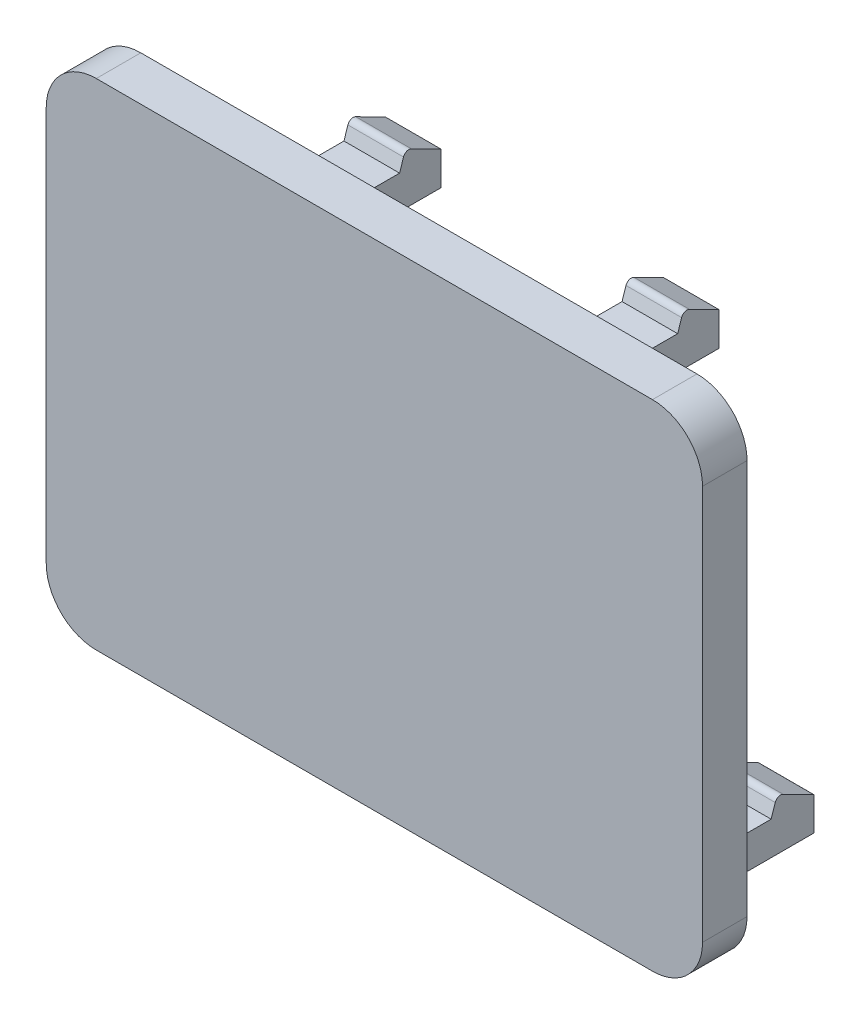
from build123d import *

# Parameters (mm, degrees)
CROQUIS2_W              = 2
CROQUIS2_H              = 50
SALIENTE_EXTRUIR1_DEPTH = 66
CROQUIS3_W              = 75.128663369
CROQUIS3_H              = 61.6519753
CORTAR_EXTRUIR1_DEPTH   = 71.669533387
SALIENTE_EXTRUIR2_DEPTH = 2
CROQUIS5_W              = 5
CROQUIS5_H              = 3
SALIENTE_EXTRUIR3_DEPTH = 14
SALIENTE_EXTRUIR4_DEPTH = 5
SALIENTE_EXTRUIR5_START = -25
SALIENTE_EXTRUIR5_DEPTH = 5
SALIENTE_EXTRUIR6_DEPTH = 5
SALIENTE_EXTRUIR7_START = -42
SALIENTE_EXTRUIR7_DEPTH = 5
CROQUIS8_W              = 3.4
CROQUIS8_H              = 1.371822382
CROQUIS8_H_2            = 1.37182238
CORTAR_EXTRUIR2_DEPTH   = 8


with BuildPart() as part:
    # Croquis2 → Saliente-Extruir1 (new body)
    with BuildSketch(Plane(origin=(0, 0, 0), x_dir=(0, 0, -1), z_dir=(1, 0, 0))):
        with Locations((2.630833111, 0)):
            Rectangle(CROQUIS2_W, CROQUIS2_H)
    extrude(amount=SALIENTE_EXTRUIR1_DEPTH)

    # Croquis3 → Cortar-Extruir1 (cut, through all)
    with BuildSketch(Plane.XY):
        with Locations((32.23805047, 1.609276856)):
            Rectangle(CROQUIS3_W, CROQUIS3_H)
        with BuildLine():
            Line((62.27689443, 17.5), (62.27689443, -18))
            ThreePointArc((62.27689443, -18), (60.958874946, -21.181980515), (57.77689443, -22.5))
            Line((57.77689443, -22.5), (7.77689443, -22.5))
            ThreePointArc((7.77689443, -22.5), (4.594913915, -21.181980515), (3.27689443, -18))
            Line((3.27689443, -18), (3.27689443, 17.5))
            ThreePointArc((3.27689443, 17.5), (4.594913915, 20.681980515), (7.77689443, 22))
            Line((7.77689443, 22), (57.77689443, 22))
            ThreePointArc((57.77689443, 22), (60.958874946, 20.681980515), (62.27689443, 17.5))
        make_face(mode=Mode.SUBTRACT)
    extrude(amount=-CORTAR_EXTRUIR1_DEPTH, mode=Mode.SUBTRACT)

    # Croquis4 → Saliente-Extruir2 (add)
    with BuildSketch(Plane(origin=(0, 0, -3.630833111), x_dir=(-1, 0, 0), z_dir=(0, 0, -1))):
        with BuildLine():
            Line((-7.77689443, 22), (-57.77689443, 22))
            ThreePointArc((-57.77689443, 22), (-60.958874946, 20.681980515), (-62.27689443, 17.5))
            Line((-62.27689443, 17.5), (-62.27689443, -18))
            ThreePointArc((-62.27689443, -18), (-60.958874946, -21.181980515), (-57.77689443, -22.5))
            Line((-57.77689443, -22.5), (-7.77689443, -22.5))
            ThreePointArc((-7.77689443, -22.5), (-4.594913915, -21.181980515), (-3.27689443, -18))
            Line((-3.27689443, -18), (-3.27689443, 17.5))
            ThreePointArc((-3.27689443, 17.5), (-4.594913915, 20.681980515), (-7.77689443, 22))
        make_face()
        with BuildLine():
            Line((-5.77689443, 20), (-59.77689443, 20))
            Line((-59.77689443, 20), (-60.27689443, 20))
            ThreePointArc((-60.27689443, 20), (-60.984001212, 19.707106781), (-61.27689443, 19))
            Line((-61.27689443, 19), (-61.27689443, -19.5))
            ThreePointArc((-61.27689443, -19.5), (-60.984001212, -20.207106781), (-60.27689443, -20.5))
            Line((-60.27689443, -20.5), (-59.77689443, -20.5))
            Line((-59.77689443, -20.5), (-5.77689443, -20.5))
            Line((-5.77689443, -20.5), (-5.27689443, -20.5))
            ThreePointArc((-5.27689443, -20.5), (-4.569787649, -20.207106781), (-4.27689443, -19.5))
            Line((-4.27689443, -19.5), (-4.27689443, 19))
            ThreePointArc((-4.27689443, 19), (-4.569787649, 19.707106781), (-5.27689443, 20))
            Line((-5.27689443, 20), (-5.77689443, 20))
        make_face(mode=Mode.SUBTRACT)
    extrude(amount=SALIENTE_EXTRUIR2_DEPTH)

    # Croquis5 → Saliente-Extruir3 (add)
    with BuildSketch(Plane(origin=(0, 0, -3.630833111), x_dir=(-1, 0, 0), z_dir=(0, 0, -1))):
        with Locations((-45.27689443, 14.5)):
            Rectangle(CROQUIS5_W, CROQUIS5_H)
        with Locations((-20.27689443, 14.5)):
            Rectangle(CROQUIS5_W, CROQUIS5_H)
        with Locations((-53.77689443, -19)):
            Rectangle(CROQUIS5_W, CROQUIS5_H)
        with Locations((-11.77689443, -19)):
            Rectangle(CROQUIS5_W, CROQUIS5_H)
    extrude(amount=SALIENTE_EXTRUIR3_DEPTH)

    # Croquis6 → Saliente-Extruir4 (add)
    with BuildSketch(Plane(origin=(47.77689443, 0, 0), x_dir=(0, 0, -1), z_dir=(1, 0, 0))):
        with BuildLine():
            Line((17.630833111, 16), (13.896730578, 16))
            Line((13.896730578, 16), (14.250149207, 17.076131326))
            ThreePointArc((14.250149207, 17.076131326), (14.534628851, 17.382384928), (14.952285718, 17.365571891))
            Line((14.952285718, 17.365571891), (17.630833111, 16))
        make_face()
    extrude(amount=-SALIENTE_EXTRUIR4_DEPTH)

    # Croquis6_2 → Saliente-Extruir5 (add)
    with BuildSketch(Plane(origin=(47.77689443, 0, 0), x_dir=(0, 0, -1), z_dir=(1, 0, 0)).offset(SALIENTE_EXTRUIR5_START)):
        with BuildLine():
            Line((17.630833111, 16), (13.896730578, 16))
            Line((13.896730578, 16), (14.250149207, 17.076131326))
            ThreePointArc((14.250149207, 17.076131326), (14.534628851, 17.382384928), (14.952285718, 17.365571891))
            Line((14.952285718, 17.365571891), (17.630833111, 16))
        make_face()
    extrude(amount=-SALIENTE_EXTRUIR5_DEPTH)

    # Croquis7 → Saliente-Extruir6 (add)
    with BuildSketch(Plane(origin=(56.27689443, 0, 0), x_dir=(0, 0, -1), z_dir=(1, 0, 0))):
        with BuildLine():
            Line((17.625964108, -17.5), (13.798330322, -17.5))
            Line((13.798330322, -17.5), (14.165163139, -16.383023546))
            ThreePointArc((14.165163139, -16.383023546), (14.449642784, -16.076769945), (14.86729965, -16.093582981))
            Line((14.86729965, -16.093582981), (17.625964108, -17.5))
        make_face()
    extrude(amount=-SALIENTE_EXTRUIR6_DEPTH)

    # Croquis7_2 → Saliente-Extruir7 (add)
    with BuildSketch(Plane(origin=(56.27689443, 0, 0), x_dir=(0, 0, -1), z_dir=(1, 0, 0)).offset(SALIENTE_EXTRUIR7_START)):
        with BuildLine():
            Line((17.625964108, -17.5), (13.798330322, -17.5))
            Line((13.798330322, -17.5), (14.165163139, -16.383023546))
            ThreePointArc((14.165163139, -16.383023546), (14.449642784, -16.076769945), (14.86729965, -16.093582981))
            Line((14.86729965, -16.093582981), (17.625964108, -17.5))
        make_face()
    extrude(amount=-SALIENTE_EXTRUIR7_DEPTH)

    # Croquis8 → Cortar-Extruir2 (cut)
    with BuildSketch(Plane(origin=(0, 0, -17.630833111), x_dir=(-1, 0, 0), z_dir=(0, 0, -1))):
        with Locations((-45.27689443, 13.685911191)):
            Rectangle(CROQUIS8_W, CROQUIS8_H)
        with Locations((-20.27689443, 13.685911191)):
            Rectangle(CROQUIS8_W, CROQUIS8_H)
        with Locations((-11.77689443, -19.81408881)):
            Rectangle(CROQUIS8_W, CROQUIS8_H_2)
        with Locations((-53.77689443, -19.81408881)):
            Rectangle(CROQUIS8_W, CROQUIS8_H_2)
    extrude(amount=-CORTAR_EXTRUIR2_DEPTH, mode=Mode.SUBTRACT)


solid = part.part
